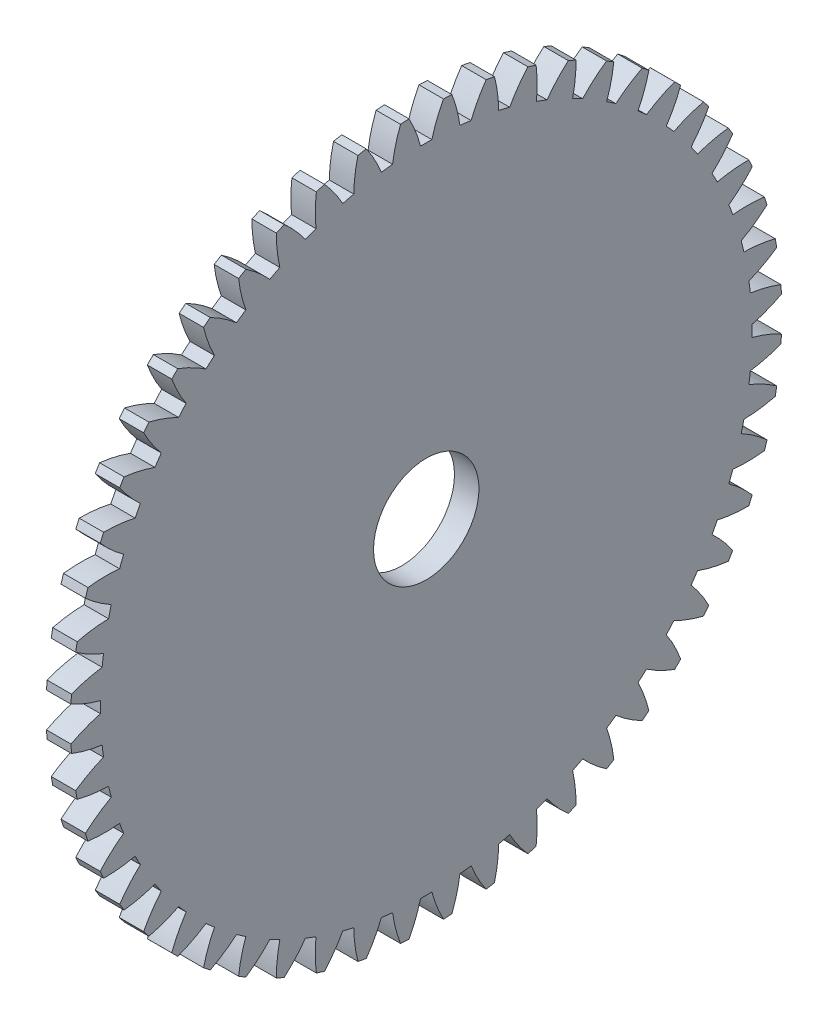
from build123d import *

# Parameters (mm, degrees)
BASPROSKE_W     = 1.4732
BASPROSKE_H     = 21.43125
TOOTHCUT_DEPTH  = 31.344147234
TEETHCUTS_COUNT = 52
TEETHCUTS_ANGLE = 353.076923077
BORSKE_R        = 3.175
BORE_DEPTH      = 50.8000508


with BuildPart() as part:
    # BasProSke → Base-Revolve (revolve)
    with BuildSketch(Plane(origin=(0, 0, 0), x_dir=(1, 0, 0), z_dir=(0, 1, 0)), mode=Mode.PRIVATE) as base_revolve_sk:
        with Locations((0.7366, 10.715625)):
            Rectangle(BASPROSKE_W, BASPROSKE_H)
    revolve(base_revolve_sk.sketch.rotate(Axis((-10, 0, 0), (1, 0, 0)), 180), axis=Axis((-10, 0, 0), (1, 0, 0)))

    # TooCutSke → ToothCut (cut, through all)
    with BuildSketch(Plane(origin=(0, 0, 0), x_dir=(0, 0, -1), z_dir=(1, 0, 0))):
        with BuildLine():
            ThreePointArc((0.340444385, 19.631248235), (0, 19.6342), (-0.340444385, 19.631248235))
            ThreePointArc((-0.340444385, 19.631248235), (-0.64320584, 20.551967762), (-1.051795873, 21.430855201))
            ThreePointArc((-1.051795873, 21.430855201), (0, 21.45665), (1.051795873, 21.430855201))
            ThreePointArc((1.051795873, 21.430855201), (0.64320584, 20.551967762), (0.340444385, 19.631248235))
        make_face()
    toothcut = extrude(amount=TOOTHCUT_DEPTH, mode=Mode.SUBTRACT)

    # TeethCuts: ToothCut ×52 about axis
    teethcuts_axis = Axis((-10, 0, 0), (1, 0, 0))
    for i in range(1, TEETHCUTS_COUNT):
        add(toothcut.rotate(teethcuts_axis, i * TEETHCUTS_ANGLE / (TEETHCUTS_COUNT - 1)), mode=Mode.SUBTRACT)

    # BorSke → Bore (cut, symmetric)
    with BuildSketch(Plane(origin=(0, 0, 0), x_dir=(0, 0, -1), z_dir=(1, 0, 0))):
        with Locations(Location((0, 0, 0), (0, 0, 180))):
            Circle(BORSKE_R)
    extrude(amount=BORE_DEPTH, both=True, mode=Mode.SUBTRACT)


solid = part.part
